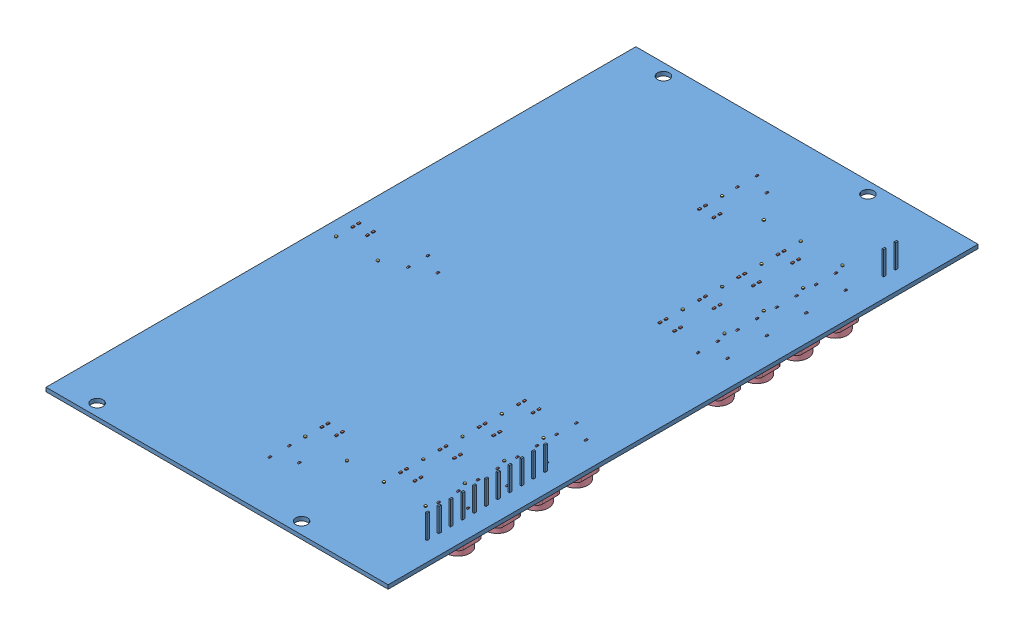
SolidWorks assembly finalIRsensorPanal.SLDASM, configuration Default (file format 9000). Lengths in mm.
Overall size (87 15.7 150).
34 component instances, 4 part files, 99 mates.
Components (placement in the parent):
- BottomIrSupport-1: BottomIrSupport.SLDPRT [Default] at (78.2308 72.7957 116.5494) size (87 7 150)
- TCR5000-1: TCR5000.SLDPRT [Default] at (82.0062 72.7957 134.5494) x (0 0 -1) z (0 -1 0) size (5.6 10 8.1)
- ohm resistance-1: ohm resistance.SLDPRT [Default] at (85.4562 70.7957 139.5494) x (1 0 0) z (0 0 -1) size (11.2 4.3 2.2)
- TCR5000-2: TCR5000.SLDPRT [Default] at (82.0062 72.7957 98.5494) x (0 0 -1) z (0 -1 0) size (5.6 10 8.1)
- ohm resistance-2: ohm resistance.SLDPRT [Default] at (85.4562 70.7957 93.5494) x (1 0 0) z (0 0 -1) size (11.2 4.3 2.2)
- TCR5000-3: TCR5000.SLDPRT [Default] at (82.0062 72.7957 144.5494) x (0 0 -1) z (0 -1 0) size (5.6 10 8.1)
- TCR5000-4: TCR5000.SLDPRT [Default] at (82.0062 72.7957 154.5494) x (0 0 -1) z (0 -1 0) size (5.6 10 8.1)
- TCR5000-5: TCR5000.SLDPRT [Default] at (82.0062 72.7957 164.5494) x (0 0 -1) z (0 -1 0) size (5.6 10 8.1)
- TCR5000-6: TCR5000.SLDPRT [Default] at (82.0062 72.7957 88.5494) x (0 0 -1) z (0 -1 0) size (5.6 10 8.1)
- TCR5000-7: TCR5000.SLDPRT [Default] at (82.0062 72.7957 78.5494) x (0 0 -1) z (0 -1 0) size (5.6 10 8.1)
- TCR5000-8: TCR5000.SLDPRT [Default] at (82.0062 72.7957 68.5494) x (0 0 -1) z (0 -1 0) size (5.6 10 8.1)
- TCR5000-9: TCR5000.SLDPRT [Default] at (62.0062 72.7957 164.5494) x (0 0 -1) z (0 -1 0) size (5.6 10 8.1)
- TCR5000-10: TCR5000.SLDPRT [Default] at (62.0062 72.7957 68.5494) x (0 0 -1) z (0 -1 0) size (5.6 10 8.1)
- ohm resistance-3: ohm resistance.SLDPRT [Default] at (85.4562 70.7957 149.5494) x (1 0 0) z (0 0 -1) size (11.2 4.3 2.2)
- ohm resistance-4: ohm resistance.SLDPRT [Default] at (85.4562 70.7957 159.5494) x (1 0 0) z (0 0 -1) size (11.2 4.3 2.2)
- ohm resistance-5: ohm resistance.SLDPRT [Default] at (85.4562 70.7957 169.5494) x (1 0 0) z (0 0 -1) size (11.2 4.3 2.2)
- ohm resistance-6: ohm resistance.SLDPRT [Default] at (85.4562 70.7957 83.5494) x (1 0 0) z (0 0 -1) size (11.2 4.3 2.2)
- ohm resistance-7: ohm resistance.SLDPRT [Default] at (85.4562 70.7957 73.5494) x (1 0 0) z (0 0 -1) size (11.2 4.3 2.2)
- ohm resistance-8: ohm resistance.SLDPRT [Default] at (85.4562 70.7957 63.5494) x (1 0 0) z (0 0 -1) size (11.2 4.3 2.2)
- ohm resistance-9: ohm resistance.SLDPRT [Default] at (65.4562 70.7957 169.5494) x (1 0 0) z (0 0 -1) size (11.2 4.3 2.2)
- ohm resistance-10: ohm resistance.SLDPRT [Default] at (65.4562 70.7957 63.5494) x (1 0 0) z (0 0 -1) size (11.2 4.3 2.2)
- TCR5000-11: TCR5000.SLDPRT [Default] at (21.8562 72.7957 116.5494) x (0 0 -1) z (0 -1 0) size (5.6 10 8.1)
- ohm resistance-11: ohm resistance.SLDPRT [Default] at (25.3173 70.7957 121.5494) x (1 0 0) z (0 0 -1) size (11.2 4.3 2.2)
- Pot - RES_VAR1-1: Pot - RES_VAR1.SLDPRT [Default] at (94.013 66.0957 134.5494) x (0 0 1) z (1 0 0) size (6.5 9.9 7.05)
- Pot - RES_VAR1-3: Pot - RES_VAR1.SLDPRT [Default] at (94.013 66.0957 144.5494) x (0 0 1) z (1 0 0) size (6.5 9.9 7.05)
- Pot - RES_VAR1-4: Pot - RES_VAR1.SLDPRT [Default] at (94.013 66.0957 154.5494) x (0 0 1) z (1 0 0) size (6.5 9.9 7.05)
- Pot - RES_VAR1-5: Pot - RES_VAR1.SLDPRT [Default] at (94.013 66.0957 164.5494) x (0 0 1) z (1 0 0) size (6.5 9.9 7.05)
- Pot - RES_VAR1-6: Pot - RES_VAR1.SLDPRT [Default] at (94.013 66.0957 98.5494) x (0 0 1) z (1 0 0) size (6.5 9.9 7.05)
- Pot - RES_VAR1-7: Pot - RES_VAR1.SLDPRT [Default] at (94.013 66.0957 88.5494) x (0 0 1) z (1 0 0) size (6.5 9.9 7.05)
- Pot - RES_VAR1-8: Pot - RES_VAR1.SLDPRT [Default] at (94.013 66.0957 78.5494) x (0 0 1) z (1 0 0) size (6.5 9.9 7.05)
- Pot - RES_VAR1-9: Pot - RES_VAR1.SLDPRT [Default] at (94.013 66.0957 68.5494) x (0 0 1) z (1 0 0) size (6.5 9.9 7.05)
- Pot - RES_VAR1-10: Pot - RES_VAR1.SLDPRT [Default] at (62.5333 66.0957 176.0071) x (0 0 1) z (1 0 0) size (6.5 9.9 7.05)
- Pot - RES_VAR1-11: Pot - RES_VAR1.SLDPRT [Default] at (38.3175 66.0957 116.5494) x (0 0 1) z (1 0 0) size (6.5 9.9 7.05)
- Pot - RES_VAR1-12: Pot - RES_VAR1.SLDPRT [Default] at (62.5333 66.0957 57.0918) x (0 0 1) z (1 0 0) size (6.5 9.9 7.05)
Mates (geometry in assembly coordinates):
- Coincident1: coincident anti-aligned: plane of BottomIrSupport-1 through (78.2308 72.7957 116.5494) normal (0 -1 0); plane of TCR5000-1 through (77.0062 72.7957 131.7494) normal (0 1 0)
- Coincident2: coincident anti-aligned: plane of BottomIrSupport-1 through (79.9562 73.7957 135.6244) normal (1 0 0); plane of TCR5000-1 through (79.9562 73.9957 133.4744) normal (-1 0 0)
- Coincident3: coincident anti-aligned: plane of BottomIrSupport-1 through (79.9562 73.7957 135.6244) normal (0 0 -1); plane of TCR5000-1 through (80.3562 73.9957 135.6244) normal (0 0 1)
- Coincident4: coincident anti-aligned: plane of BottomIrSupport-1 through (78.2308 73.7957 116.5494) normal (0 1 0); plane of ohm resistance-1 through (80.1562 73.7957 139.5494) normal (0 -1 0)
- Concentric1: concentric anti-aligned: cylinder of BottomIrSupport-1 through (80.1562 73.7957 139.5494) axis (0 -1 0) radius 0.25; cylinder of ohm resistance-1 through (80.1562 71.7957 139.5494) axis (0 1 0) radius 0.25
- Concentric2: concentric anti-aligned: cylinder of BottomIrSupport-1 through (90.7562 73.7957 139.5494) axis (0 -1 0) radius 0.25; cylinder of ohm resistance-1 through (90.7562 71.7957 139.5494) axis (0 1 0) radius 0.25
- Coincident6: coincident anti-aligned: plane of BottomIrSupport-1 through (79.9562 73.7957 99.6244) normal (1 0 0); plane of TCR5000-2 through (79.9562 73.9957 99.6244) normal (-1 0 0)
- Coincident7: coincident anti-aligned: plane of BottomIrSupport-1 through (79.9562 73.7957 99.6244) normal (0 0 -1); plane of TCR5000-2 through (80.3562 73.9957 99.6244) normal (0 0 1)
- Coincident8: coincident anti-aligned: plane of BottomIrSupport-1 through (78.2308 72.7957 116.5494) normal (0 -1 0); plane of TCR5000-2 through (77.0062 72.7957 95.7494) normal (0 1 0)
- Coincident9: coincident anti-aligned: plane of BottomIrSupport-1 through (78.2308 73.7957 116.5494) normal (0 1 0); plane of ohm resistance-2 through (80.1562 73.7957 93.5494) normal (0 -1 0)
- Concentric3: concentric anti-aligned: cylinder of BottomIrSupport-1 through (80.1562 73.7957 93.5494) axis (0 -1 0) radius 0.25; cylinder of ohm resistance-2 through (80.1562 71.7957 93.5494) axis (0 1 0) radius 0.25
- Concentric4: concentric anti-aligned: cylinder of BottomIrSupport-1 through (90.7562 73.7957 93.5494) axis (0 -1 0) radius 0.25; cylinder of ohm resistance-2 through (90.7562 71.7957 93.5494) axis (0 1 0) radius 0.25
- Coincident10: coincident anti-aligned: plane of BottomIrSupport-1 through (78.2308 72.7957 116.5494) normal (0 -1 0); plane of TCR5000-3 through (77.0062 72.7957 141.7494) normal (0 1 0)
- Coincident11: coincident anti-aligned: plane of BottomIrSupport-1 through (79.9562 73.7957 145.6244) normal (1 0 0); plane of TCR5000-3 through (79.9562 73.9957 145.6244) normal (-1 0 0)
- Coincident12: coincident anti-aligned: plane of BottomIrSupport-1 through (79.9562 73.7957 145.6244) normal (0 0 -1); plane of TCR5000-3 through (80.3562 73.9957 145.6244) normal (0 0 1)
- Coincident13: coincident anti-aligned: plane of BottomIrSupport-1 through (78.2308 72.7957 116.5494) normal (0 -1 0); plane of TCR5000-4 through (77.0062 72.7957 151.7494) normal (0 1 0)
- Coincident14: coincident anti-aligned: plane of BottomIrSupport-1 through (79.9562 73.7957 155.6244) normal (0 0 -1); plane of TCR5000-4 through (80.3562 73.9957 155.6244) normal (0 0 1)
- Coincident15: coincident anti-aligned: plane of BottomIrSupport-1 through (79.9562 73.7957 155.6244) normal (1 0 0); plane of TCR5000-4 through (79.9562 73.9957 155.6244) normal (-1 0 0)
- Coincident16: coincident anti-aligned: plane of BottomIrSupport-1 through (78.2308 72.7957 116.5494) normal (0 -1 0); plane of TCR5000-5 through (77.0062 72.7957 161.7494) normal (0 1 0)
- Coincident17: coincident anti-aligned: plane of BottomIrSupport-1 through (79.9562 73.7957 165.6244) normal (0 0 -1); plane of TCR5000-5 through (80.3562 73.9957 165.6244) normal (0 0 1)
- Coincident18: coincident anti-aligned: plane of BottomIrSupport-1 through (79.9562 73.7957 165.6244) normal (1 0 0); plane of TCR5000-5 through (79.9562 73.9957 165.6244) normal (-1 0 0)
- Coincident19: coincident anti-aligned: plane of BottomIrSupport-1 through (78.2308 72.7957 116.5494) normal (0 -1 0); plane of TCR5000-6 through (77.0062 72.7957 85.7494) normal (0 1 0)
- Coincident20: coincident anti-aligned: plane of BottomIrSupport-1 through (79.9562 73.7957 89.6244) normal (0 0 -1); plane of TCR5000-6 through (80.3562 73.9957 89.6244) normal (0 0 1)
- Coincident21: coincident anti-aligned: plane of BottomIrSupport-1 through (79.9562 73.7957 89.6244) normal (1 0 0); plane of TCR5000-6 through (79.9562 73.9957 89.6244) normal (-1 0 0)
- Coincident22: coincident anti-aligned: plane of BottomIrSupport-1 through (78.2308 72.7957 116.5494) normal (0 -1 0); plane of TCR5000-7 through (77.0062 72.7957 75.7494) normal (0 1 0)
- Coincident23: coincident anti-aligned: plane of BottomIrSupport-1 through (79.9562 73.7957 79.6244) normal (0 0 -1); plane of TCR5000-7 through (80.3562 73.9957 79.6244) normal (0 0 1)
- Coincident24: coincident anti-aligned: plane of BottomIrSupport-1 through (79.9562 73.7957 79.6244) normal (1 0 0); plane of TCR5000-7 through (79.9562 73.9957 79.6244) normal (-1 0 0)
- Coincident25: coincident anti-aligned: plane of BottomIrSupport-1 through (78.2308 72.7957 116.5494) normal (0 -1 0); plane of TCR5000-8 through (77.0062 72.7957 65.7494) normal (0 1 0)
- Coincident26: coincident anti-aligned: plane of BottomIrSupport-1 through (79.9562 73.7957 69.6244) normal (0 0 -1); plane of TCR5000-8 through (80.3562 73.9957 69.6244) normal (0 0 1)
- Coincident27: coincident anti-aligned: plane of BottomIrSupport-1 through (79.9562 73.7957 69.6244) normal (1 0 0); plane of TCR5000-8 through (79.9562 73.9957 69.6244) normal (-1 0 0)
- Coincident28: coincident anti-aligned: plane of BottomIrSupport-1 through (78.2308 72.7957 116.5494) normal (0 -1 0); plane of TCR5000-9 through (57.0062 72.7957 161.7494) normal (0 1 0)
- Coincident29: coincident anti-aligned: plane of BottomIrSupport-1 through (59.9562 73.7957 165.6244) normal (0 0 -1); plane of TCR5000-9 through (60.3562 73.9957 165.6244) normal (0 0 1)
- Coincident30: coincident anti-aligned: plane of BottomIrSupport-1 through (59.9562 73.7957 165.6244) normal (1 0 0); plane of TCR5000-9 through (59.9562 73.9957 165.6244) normal (-1 0 0)
- Coincident31: coincident anti-aligned: plane of BottomIrSupport-1 through (78.2308 72.7957 116.5494) normal (0 -1 0); plane of TCR5000-10 through (57.0062 72.7957 65.7494) normal (0 1 0)
- Coincident32: coincident anti-aligned: plane of BottomIrSupport-1 through (59.9562 73.7957 69.6244) normal (0 0 -1); plane of TCR5000-10 through (60.3562 73.9957 69.6244) normal (0 0 1)
- Coincident33: coincident anti-aligned: plane of BottomIrSupport-1 through (60.3562 73.7957 69.6244) normal (-1 0 0); plane of TCR5000-10 through (60.3562 73.9957 69.6244) normal (1 0 0)
- Coincident34: coincident anti-aligned: plane of BottomIrSupport-1 through (78.2308 73.7957 116.5494) normal (0 1 0); plane of ohm resistance-3 through (80.1562 73.7957 149.5494) normal (0 -1 0)
- Concentric5: concentric anti-aligned: cylinder of BottomIrSupport-1 through (80.1562 73.7957 149.5494) axis (0 -1 0) radius 0.25; cylinder of ohm resistance-3 through (80.1562 71.7957 149.5494) axis (0 1 0) radius 0.25
- Concentric6: concentric anti-aligned: cylinder of BottomIrSupport-1 through (90.7562 73.7957 149.5494) axis (0 -1 0) radius 0.25; cylinder of ohm resistance-3 through (90.7562 71.7957 149.5494) axis (0 1 0) radius 0.25
- Coincident35: coincident anti-aligned: plane of BottomIrSupport-1 through (78.2308 73.7957 116.5494) normal (0 1 0); plane of ohm resistance-4 through (90.7562 73.7957 159.5494) normal (0 -1 0)
- Concentric7: concentric anti-aligned: cylinder of BottomIrSupport-1 through (80.1562 73.7957 159.5494) axis (0 -1 0) radius 0.25; cylinder of ohm resistance-4 through (80.1562 71.7957 159.5494) axis (0 1 0) radius 0.25
- Concentric8: concentric anti-aligned: cylinder of BottomIrSupport-1 through (90.7562 73.7957 159.5494) axis (0 -1 0) radius 0.25; cylinder of ohm resistance-4 through (90.7562 71.7957 159.5494) axis (0 1 0) radius 0.25
- Coincident36: coincident anti-aligned: plane of BottomIrSupport-1 through (78.2308 73.7957 116.5494) normal (0 1 0); plane of ohm resistance-5 through (80.1562 73.7957 169.5494) normal (0 -1 0)
- Concentric9: concentric anti-aligned: cylinder of BottomIrSupport-1 through (80.1562 73.7957 169.5494) axis (0 -1 0) radius 0.25; cylinder of ohm resistance-5 through (80.1562 71.7957 169.5494) axis (0 1 0) radius 0.25
- Concentric10: concentric anti-aligned: cylinder of BottomIrSupport-1 through (90.7562 73.7957 169.5494) axis (0 -1 0) radius 0.25; cylinder of ohm resistance-5 through (90.7562 71.7957 169.5494) axis (0 1 0) radius 0.25
- Coincident37: coincident anti-aligned: plane of BottomIrSupport-1 through (78.2308 73.7957 116.5494) normal (0 1 0); plane of ohm resistance-6 through (90.7562 73.7957 83.5494) normal (0 -1 0)
- Concentric11: concentric anti-aligned: cylinder of BottomIrSupport-1 through (90.7562 73.7957 83.5494) axis (0 -1 0) radius 0.25; cylinder of ohm resistance-6 through (90.7562 71.7957 83.5494) axis (0 1 0) radius 0.25
- Concentric12: concentric anti-aligned: cylinder of BottomIrSupport-1 through (80.1562 73.7957 83.5494) axis (0 -1 0) radius 0.25; cylinder of ohm resistance-6 through (80.1562 71.7957 83.5494) axis (0 1 0) radius 0.25
- Coincident38: coincident anti-aligned: plane of BottomIrSupport-1 through (78.2308 73.7957 116.5494) normal (0 1 0); plane of ohm resistance-7 through (90.7562 73.7957 73.5494) normal (0 -1 0)
- Concentric13: concentric anti-aligned: cylinder of BottomIrSupport-1 through (80.1562 73.7957 73.5494) axis (0 -1 0) radius 0.25; cylinder of ohm resistance-7 through (80.1562 71.7957 73.5494) axis (0 1 0) radius 0.25
- Concentric14: concentric anti-aligned: cylinder of BottomIrSupport-1 through (90.7562 73.7957 73.5494) axis (0 -1 0) radius 0.25; cylinder of ohm resistance-7 through (90.7562 71.7957 73.5494) axis (0 1 0) radius 0.25
- Coincident40: coincident anti-aligned: plane of BottomIrSupport-1 through (78.2308 73.7957 116.5494) normal (0 1 0); plane of ohm resistance-8 through (90.7562 73.7957 63.5494) normal (0 -1 0)
- Concentric15: concentric anti-aligned: cylinder of BottomIrSupport-1 through (80.1562 73.7957 63.5494) axis (0 -1 0) radius 0.25; cylinder of ohm resistance-8 through (80.1562 71.7957 63.5494) axis (0 1 0) radius 0.25
- Concentric16: concentric anti-aligned: cylinder of BottomIrSupport-1 through (90.7562 73.7957 63.5494) axis (0 -1 0) radius 0.25; cylinder of ohm resistance-8 through (90.7562 71.7957 63.5494) axis (0 1 0) radius 0.25
- Coincident41: coincident anti-aligned: plane of BottomIrSupport-1 through (78.2308 73.7957 116.5494) normal (0 1 0); plane of ohm resistance-9 through (70.7562 73.7957 169.5494) normal (0 -1 0)
- Concentric17: concentric anti-aligned: cylinder of BottomIrSupport-1 through (60.1562 73.7957 169.5494) axis (0 -1 0) radius 0.25; cylinder of ohm resistance-9 through (60.1562 71.7957 169.5494) axis (0 1 0) radius 0.25
- Concentric18: concentric anti-aligned: cylinder of BottomIrSupport-1 through (70.7562 73.7957 169.5494) axis (0 -1 0) radius 0.25; cylinder of ohm resistance-9 through (70.7562 71.7957 169.5494) axis (0 1 0) radius 0.25
- Coincident42: coincident anti-aligned: plane of BottomIrSupport-1 through (78.2308 73.7957 116.5494) normal (0 1 0); plane of ohm resistance-10 through (60.1562 73.7957 63.5494) normal (0 -1 0)
- Concentric19: concentric anti-aligned: cylinder of BottomIrSupport-1 through (60.1562 73.7957 63.5494) axis (0 -1 0) radius 0.25; cylinder of ohm resistance-10 through (60.1562 71.7957 63.5494) axis (0 1 0) radius 0.25
- Concentric20: concentric anti-aligned: cylinder of BottomIrSupport-1 through (70.7562 73.7957 63.5494) axis (0 -1 0) radius 0.25; cylinder of ohm resistance-10 through (70.7562 71.7957 63.5494) axis (0 1 0) radius 0.25
- Coincident43: coincident anti-aligned: plane of BottomIrSupport-1 through (78.2308 72.7957 116.5494) normal (0 -1 0); plane of TCR5000-11 through (16.8562 72.7957 113.7494) normal (0 1 0)
- Coincident44: coincident anti-aligned: plane of BottomIrSupport-1 through (19.8062 72.7957 117.6244) normal (0 0 -1); plane of TCR5000-11 through (20.2062 73.9957 117.6244) normal (0 0 1)
- Coincident45: coincident anti-aligned: plane of BottomIrSupport-1 through (19.8062 72.7957 116.9744) normal (1 0 0); plane of TCR5000-11 through (19.8062 73.9957 117.6244) normal (-1 0 0)
- Coincident46: coincident anti-aligned: plane of BottomIrSupport-1 through (78.2308 73.7957 116.5494) normal (0 1 0); plane of ohm resistance-11 through (20.0173 73.7957 121.5494) normal (0 -1 0)
- Concentric21: concentric aligned: cylinder of BottomIrSupport-1 through (20.0173 72.7957 121.5494) axis (0 1 0) radius 0.25; cylinder of ohm resistance-11 through (20.0173 71.7957 121.5494) axis (0 1 0) radius 0.25
- Concentric22: concentric aligned: cylinder of BottomIrSupport-1 through (30.6173 72.7957 121.5494) axis (0 1 0) radius 0.25; cylinder of ohm resistance-11 through (30.6173 71.7957 121.5494) axis (0 1 0) radius 0.25
- Coincident48: coincident: plane of BottomIrSupport-1 through (78.2308 73.7957 116.5494) normal (0 1 0); line of Pot - RES_VAR1-1 through (96.448 73.7957 134.1994) axis (1 0 0)
- Coincident49: coincident anti-aligned: plane of BottomIrSupport-1 through (96.448 73.7957 134.8994) normal (0 0 -1); plane of Pot - RES_VAR1-1 through (96.448 73.9957 134.8994) normal (0 0 1)
- Coincident50: coincident anti-aligned: plane of BottomIrSupport-1 through (96.748 73.7957 134.8994) normal (-1 0 0); plane of Pot - RES_VAR1-1 through (96.748 71.4957 133.3494) normal (1 0 0)
- Coincident54: coincident: plane of BottomIrSupport-1 through (78.2308 73.7957 116.5494) normal (0 1 0); line of Pot - RES_VAR1-3 through (96.448 73.7957 144.1994) axis (1 0 0)
- Coincident55: coincident anti-aligned: plane of BottomIrSupport-1 through (96.448 73.7957 144.1994) normal (0 0 1); plane of Pot - RES_VAR1-3 through (96.448 73.9957 144.1994) normal (0 0 -1)
- Coincident56: coincident anti-aligned: plane of BottomIrSupport-1 through (96.748 73.7957 144.8994) normal (-1 0 0); plane of Pot - RES_VAR1-3 through (96.748 71.4957 143.3494) normal (1 0 0)
- Coincident57: coincident: plane of BottomIrSupport-1 through (78.2308 73.7957 116.5494) normal (0 1 0); line of Pot - RES_VAR1-4 through (96.448 73.7957 154.1994) axis (1 0 0)
- Coincident58: coincident anti-aligned: plane of BottomIrSupport-1 through (96.748 73.7957 154.8994) normal (-1 0 0); plane of Pot - RES_VAR1-4 through (96.748 71.4957 153.3494) normal (1 0 0)
- Coincident59: coincident anti-aligned: plane of BottomIrSupport-1 through (96.448 73.7957 154.8994) normal (0 0 -1); plane of Pot - RES_VAR1-4 through (96.448 73.9957 154.8994) normal (0 0 1)
- Coincident60: coincident: plane of BottomIrSupport-1 through (78.2308 73.7957 116.5494) normal (0 1 0); line of Pot - RES_VAR1-5 through (96.448 73.7957 164.1994) axis (1 0 0)
- Coincident61: coincident anti-aligned: plane of BottomIrSupport-1 through (96.748 73.7957 164.8994) normal (-1 0 0); plane of Pot - RES_VAR1-5 through (96.748 71.4957 163.3494) normal (1 0 0)
- Coincident62: coincident anti-aligned: plane of BottomIrSupport-1 through (96.448 73.7957 164.8994) normal (0 0 -1); plane of Pot - RES_VAR1-5 through (96.448 73.9957 164.8994) normal (0 0 1)
- Coincident63: coincident: plane of BottomIrSupport-1 through (78.2308 73.7957 116.5494) normal (0 1 0); line of Pot - RES_VAR1-6 through (96.448 73.7957 98.1994) axis (1 0 0)
- Coincident64: coincident anti-aligned: plane of BottomIrSupport-1 through (96.448 73.7957 98.8994) normal (0 0 -1); plane of Pot - RES_VAR1-6 through (96.448 73.9957 98.8994) normal (0 0 1)
- Coincident65: coincident anti-aligned: plane of BottomIrSupport-1 through (96.748 73.7957 98.1994) normal (-1 0 0); plane of Pot - RES_VAR1-6 through (96.748 71.4957 97.3494) normal (1 0 0)
- Coincident66: coincident: plane of BottomIrSupport-1 through (78.2308 73.7957 116.5494) normal (0 1 0); line of Pot - RES_VAR1-7 through (96.448 73.7957 88.1994) axis (1 0 0)
- Coincident67: coincident anti-aligned: plane of BottomIrSupport-1 through (96.448 73.7957 88.8994) normal (0 0 -1); plane of Pot - RES_VAR1-7 through (96.448 73.9957 88.8994) normal (0 0 1)
- Coincident68: coincident anti-aligned: plane of BottomIrSupport-1 through (96.748 73.7957 88.1994) normal (-1 0 0); plane of Pot - RES_VAR1-7 through (96.748 71.4957 87.3494) normal (1 0 0)
- Coincident69: coincident: plane of BottomIrSupport-1 through (78.2308 73.7957 116.5494) normal (0 1 0); line of Pot - RES_VAR1-8 through (96.448 73.7957 78.1994) axis (1 0 0)
- Coincident70: coincident anti-aligned: plane of BottomIrSupport-1 through (96.448 73.7957 78.8994) normal (0 0 -1); plane of Pot - RES_VAR1-8 through (96.448 73.9957 78.8994) normal (0 0 1)
- Coincident71: coincident anti-aligned: plane of BottomIrSupport-1 through (96.748 73.7957 78.1994) normal (-1 0 0); plane of Pot - RES_VAR1-8 through (96.748 71.4957 77.3494) normal (1 0 0)
- Coincident72: coincident: plane of BottomIrSupport-1 through (78.2308 73.7957 116.5494) normal (0 1 0); line of Pot - RES_VAR1-9 through (96.448 73.7957 68.1994) axis (1 0 0)
- Coincident73: coincident anti-aligned: plane of BottomIrSupport-1 through (96.448 73.7957 68.1994) normal (0 0 1); plane of Pot - RES_VAR1-9 through (96.448 73.9957 68.1994) normal (0 0 -1)
- Coincident74: coincident anti-aligned: plane of BottomIrSupport-1 through (96.748 73.7957 68.1994) normal (-1 0 0); plane of Pot - RES_VAR1-9 through (96.748 71.4957 67.3494) normal (1 0 0)
- Coincident75: coincident: plane of BottomIrSupport-1 through (78.2308 73.7957 116.5494) normal (0 1 0); line of Pot - RES_VAR1-10 through (59.9733 73.7957 173.1571) axis (1 0 0)
- Coincident76: coincident anti-aligned: plane of BottomIrSupport-1 through (64.9683 73.7957 176.3571) normal (0 0 -1); plane of Pot - RES_VAR1-10 through (64.9683 73.9957 176.3571) normal (0 0 1)
- Coincident77: coincident anti-aligned: plane of BottomIrSupport-1 through (65.2683 73.7957 176.3571) normal (-1 0 0); plane of Pot - RES_VAR1-10 through (65.2683 71.4957 174.8071) normal (1 0 0)
- Coincident78: coincident: plane of BottomIrSupport-1 through (78.2308 73.7957 116.5494) normal (0 1 0); line of Pot - RES_VAR1-11 through (41.0525 73.7957 116.8994) axis (-1 0 0)
- Coincident79: coincident anti-aligned: plane of BottomIrSupport-1 through (40.7525 72.7957 116.8994) normal (0 0 -1); plane of Pot - RES_VAR1-11 through (40.7525 73.9957 116.8994) normal (0 0 1)
- Coincident80: coincident anti-aligned: plane of BottomIrSupport-1 through (41.0525 72.7957 116.1994) normal (-1 0 0); plane of Pot - RES_VAR1-11 through (41.0525 71.4957 115.3494) normal (1 0 0)
- Coincident81: coincident: plane of BottomIrSupport-1 through (78.2308 73.7957 116.5494) normal (0 1 0); line of Pot - RES_VAR1-12 through (65.2683 73.7957 57.4418) axis (-1 0 0)
- Coincident82: coincident anti-aligned: plane of BottomIrSupport-1 through (64.9683 73.7957 57.4418) normal (0 0 -1); plane of Pot - RES_VAR1-12 through (64.9683 73.9957 57.4418) normal (0 0 1)
- Coincident84: coincident anti-aligned: plane of BottomIrSupport-1 through (65.2683 73.7957 56.7418) normal (-1 0 0); plane of Pot - RES_VAR1-12 through (65.2683 71.4957 55.8918) normal (1 0 0)
